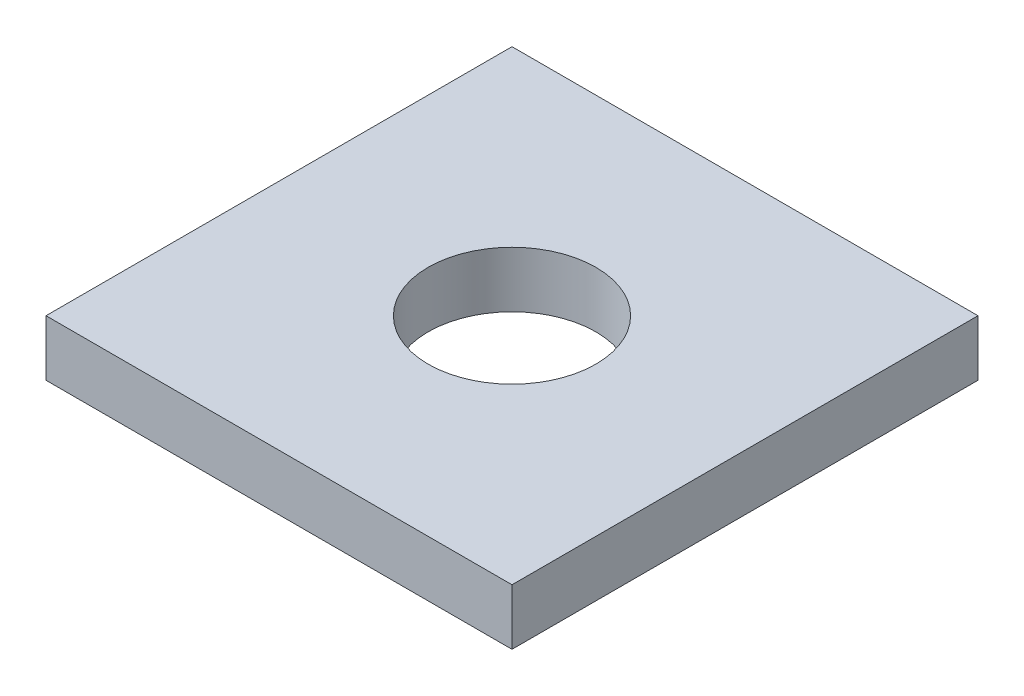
ISO-10303-21;
HEADER;
FILE_DESCRIPTION(('STEP AP214'),'2;1');
FILE_NAME('part.step','',(''),(''),'','','');
FILE_SCHEMA(('AUTOMOTIVE_DESIGN { 1 0 10303 214 1 1 1 1 }'));
ENDSEC;
DATA;
#1=APPLICATION_CONTEXT('core data for automotive mechanical design processes');
#2=APPLICATION_PROTOCOL_DEFINITION('international standard','automotive_design',2000,#1);
#3=PRODUCT_CONTEXT('',#1,'mechanical');
#4=PRODUCT('Part','Part','',(#3));
#5=PRODUCT_RELATED_PRODUCT_CATEGORY('part','',(#4));
#6=PRODUCT_DEFINITION_FORMATION('','',#4);
#7=PRODUCT_DEFINITION_CONTEXT('part definition',#1,'design');
#8=PRODUCT_DEFINITION('design','',#6,#7);
#9=PRODUCT_DEFINITION_SHAPE('','',#8);
#10=(LENGTH_UNIT() NAMED_UNIT(*) SI_UNIT(.MILLI.,.METRE.));
#11=(NAMED_UNIT(*) PLANE_ANGLE_UNIT() SI_UNIT($,.RADIAN.));
#12=(NAMED_UNIT(*) SI_UNIT($,.STERADIAN.) SOLID_ANGLE_UNIT());
#13=UNCERTAINTY_MEASURE_WITH_UNIT(LENGTH_MEASURE(1.E-05),#10,'distance_accuracy_value','');
#14=(GEOMETRIC_REPRESENTATION_CONTEXT(3) GLOBAL_UNCERTAINTY_ASSIGNED_CONTEXT((#13)) GLOBAL_UNIT_ASSIGNED_CONTEXT((#10,
#11,#12)) REPRESENTATION_CONTEXT('',''));
#15=CARTESIAN_POINT('',(0.,0.,0.));
#16=DIRECTION('',(0.,0.,1.));
#17=DIRECTION('',(1.,0.,0.));
#18=AXIS2_PLACEMENT_3D('',#15,#16,#17);
#19=CARTESIAN_POINT('',(0.,3.,-25.));
#20=DIRECTION('',(0.,-1.,0.));
#21=DIRECTION('',(0.,0.,-1.));
#22=AXIS2_PLACEMENT_3D('',#19,#20,#21);
#23=PLANE('',#22);
#24=DIRECTION('',(0.,0.,1.));
#25=VECTOR('',#24,1.);
#26=CARTESIAN_POINT('',(0.,3.,0.));
#27=LINE('',#26,#25);
#28=CARTESIAN_POINT('',(0.,3.,-25.));
#29=VERTEX_POINT('',#28);
#30=CARTESIAN_POINT('',(0.,3.,0.));
#31=VERTEX_POINT('',#30);
#32=EDGE_CURVE('E83',#29,#31,#27,.T.);
#33=ORIENTED_EDGE('',*,*,#32,.T.);
#34=DIRECTION('',(1.,0.,0.));
#35=VECTOR('',#34,1.);
#36=CARTESIAN_POINT('',(0.,3.,0.));
#37=LINE('',#36,#35);
#38=CARTESIAN_POINT('',(25.,3.,0.));
#39=VERTEX_POINT('',#38);
#40=EDGE_CURVE('E78',#31,#39,#37,.T.);
#41=ORIENTED_EDGE('',*,*,#40,.T.);
#42=DIRECTION('',(0.,0.,-1.));
#43=VECTOR('',#42,1.);
#44=CARTESIAN_POINT('',(25.,3.,0.));
#45=LINE('',#44,#43);
#46=CARTESIAN_POINT('',(25.,3.,-25.));
#47=VERTEX_POINT('',#46);
#48=EDGE_CURVE('E81',#39,#47,#45,.T.);
#49=ORIENTED_EDGE('',*,*,#48,.T.);
#50=DIRECTION('',(-1.,0.,0.));
#51=VECTOR('',#50,1.);
#52=CARTESIAN_POINT('',(0.,3.,-25.));
#53=LINE('',#52,#51);
#54=EDGE_CURVE('E48',#47,#29,#53,.T.);
#55=ORIENTED_EDGE('',*,*,#54,.T.);
#56=EDGE_LOOP('',(#33,#41,#49,#55));
#57=FACE_BOUND('',#56,.T.);
#58=CARTESIAN_POINT('',(12.5,3.,-12.5));
#59=DIRECTION('',(0.,1.,0.));
#60=DIRECTION('',(0.,0.,1.));
#61=AXIS2_PLACEMENT_3D('',#58,#59,#60);
#62=CIRCLE('',#61,4.5);
#63=CARTESIAN_POINT('',(12.5,3.,-8.));
#64=VERTEX_POINT('',#63);
#65=EDGE_CURVE('E98',#64,#64,#62,.T.);
#66=ORIENTED_EDGE('',*,*,#65,.F.);
#67=EDGE_LOOP('',(#66));
#68=FACE_BOUND('',#67,.T.);
#69=ADVANCED_FACE('F31',(#57,#68),#23,.F.);
#70=CARTESIAN_POINT('',(0.,0.,-25.));
#71=DIRECTION('',(0.,-1.,0.));
#72=DIRECTION('',(0.,0.,-1.));
#73=AXIS2_PLACEMENT_3D('',#70,#71,#72);
#74=PLANE('',#73);
#75=DIRECTION('',(0.,0.,1.));
#76=VECTOR('',#75,1.);
#77=CARTESIAN_POINT('',(0.,0.,0.));
#78=LINE('',#77,#76);
#79=CARTESIAN_POINT('',(0.,0.,-25.));
#80=VERTEX_POINT('',#79);
#81=CARTESIAN_POINT('',(0.,0.,0.));
#82=VERTEX_POINT('',#81);
#83=EDGE_CURVE('E95',#80,#82,#78,.T.);
#84=ORIENTED_EDGE('',*,*,#83,.F.);
#85=DIRECTION('',(-1.,0.,0.));
#86=VECTOR('',#85,1.);
#87=CARTESIAN_POINT('',(0.,0.,-25.));
#88=LINE('',#87,#86);
#89=CARTESIAN_POINT('',(25.,0.,-25.));
#90=VERTEX_POINT('',#89);
#91=EDGE_CURVE('E71',#90,#80,#88,.T.);
#92=ORIENTED_EDGE('',*,*,#91,.F.);
#93=DIRECTION('',(0.,0.,-1.));
#94=VECTOR('',#93,1.);
#95=CARTESIAN_POINT('',(25.,0.,0.));
#96=LINE('',#95,#94);
#97=CARTESIAN_POINT('',(25.,0.,0.));
#98=VERTEX_POINT('',#97);
#99=EDGE_CURVE('E65',#98,#90,#96,.T.);
#100=ORIENTED_EDGE('',*,*,#99,.F.);
#101=DIRECTION('',(1.,0.,0.));
#102=VECTOR('',#101,1.);
#103=CARTESIAN_POINT('',(0.,0.,0.));
#104=LINE('',#103,#102);
#105=EDGE_CURVE('E87',#82,#98,#104,.T.);
#106=ORIENTED_EDGE('',*,*,#105,.F.);
#107=EDGE_LOOP('',(#84,#92,#100,#106));
#108=FACE_BOUND('',#107,.T.);
#109=CARTESIAN_POINT('',(12.5,0.,-12.5));
#110=DIRECTION('',(0.,1.,0.));
#111=DIRECTION('',(0.,0.,1.));
#112=AXIS2_PLACEMENT_3D('',#109,#110,#111);
#113=CIRCLE('',#112,4.5);
#114=CARTESIAN_POINT('',(12.5,0.,-8.));
#115=VERTEX_POINT('',#114);
#116=EDGE_CURVE('E110',#115,#115,#113,.T.);
#117=ORIENTED_EDGE('',*,*,#116,.T.);
#118=EDGE_LOOP('',(#117));
#119=FACE_BOUND('',#118,.T.);
#120=ADVANCED_FACE('F106',(#108,#119),#74,.T.);
#121=CARTESIAN_POINT('',(0.,3.,0.));
#122=DIRECTION('',(1.,0.,0.));
#123=DIRECTION('',(0.,0.,-1.));
#124=AXIS2_PLACEMENT_3D('',#121,#122,#123);
#125=PLANE('',#124);
#126=ORIENTED_EDGE('',*,*,#83,.T.);
#127=DIRECTION('',(0.,-1.,0.));
#128=VECTOR('',#127,1.);
#129=CARTESIAN_POINT('',(0.,3.,0.));
#130=LINE('',#129,#128);
#131=EDGE_CURVE('E11',#31,#82,#130,.T.);
#132=ORIENTED_EDGE('',*,*,#131,.F.);
#133=ORIENTED_EDGE('',*,*,#32,.F.);
#134=DIRECTION('',(0.,-1.,0.));
#135=VECTOR('',#134,1.);
#136=CARTESIAN_POINT('',(0.,3.,-25.));
#137=LINE('',#136,#135);
#138=EDGE_CURVE('E91',#29,#80,#137,.T.);
#139=ORIENTED_EDGE('',*,*,#138,.T.);
#140=EDGE_LOOP('',(#126,#132,#133,#139));
#141=FACE_BOUND('',#140,.T.);
#142=ADVANCED_FACE('F33',(#141),#125,.F.);
#143=CARTESIAN_POINT('',(0.,3.,0.));
#144=DIRECTION('',(0.,0.,-1.));
#145=DIRECTION('',(-1.,0.,0.));
#146=AXIS2_PLACEMENT_3D('',#143,#144,#145);
#147=PLANE('',#146);
#148=ORIENTED_EDGE('',*,*,#105,.T.);
#149=DIRECTION('',(0.,-1.,0.));
#150=VECTOR('',#149,1.);
#151=CARTESIAN_POINT('',(25.,3.,0.));
#152=LINE('',#151,#150);
#153=EDGE_CURVE('E40',#39,#98,#152,.T.);
#154=ORIENTED_EDGE('',*,*,#153,.F.);
#155=ORIENTED_EDGE('',*,*,#40,.F.);
#156=ORIENTED_EDGE('',*,*,#131,.T.);
#157=EDGE_LOOP('',(#148,#154,#155,#156));
#158=FACE_BOUND('',#157,.T.);
#159=ADVANCED_FACE('F86',(#158),#147,.F.);
#160=CARTESIAN_POINT('',(25.,3.,0.));
#161=DIRECTION('',(-1.,0.,0.));
#162=DIRECTION('',(0.,0.,1.));
#163=AXIS2_PLACEMENT_3D('',#160,#161,#162);
#164=PLANE('',#163);
#165=ORIENTED_EDGE('',*,*,#99,.T.);
#166=DIRECTION('',(0.,-1.,0.));
#167=VECTOR('',#166,1.);
#168=CARTESIAN_POINT('',(25.,3.,-25.));
#169=LINE('',#168,#167);
#170=EDGE_CURVE('E88',#47,#90,#169,.T.);
#171=ORIENTED_EDGE('',*,*,#170,.F.);
#172=ORIENTED_EDGE('',*,*,#48,.F.);
#173=ORIENTED_EDGE('',*,*,#153,.T.);
#174=EDGE_LOOP('',(#165,#171,#172,#173));
#175=FACE_BOUND('',#174,.T.);
#176=ADVANCED_FACE('F89',(#175),#164,.F.);
#177=CARTESIAN_POINT('',(0.,3.,-25.));
#178=DIRECTION('',(0.,0.,1.));
#179=DIRECTION('',(1.,0.,0.));
#180=AXIS2_PLACEMENT_3D('',#177,#178,#179);
#181=PLANE('',#180);
#182=ORIENTED_EDGE('',*,*,#91,.T.);
#183=ORIENTED_EDGE('',*,*,#138,.F.);
#184=ORIENTED_EDGE('',*,*,#54,.F.);
#185=ORIENTED_EDGE('',*,*,#170,.T.);
#186=EDGE_LOOP('',(#182,#183,#184,#185));
#187=FACE_BOUND('',#186,.T.);
#188=ADVANCED_FACE('F103',(#187),#181,.F.);
#189=CARTESIAN_POINT('',(12.5,3.,-12.5));
#190=DIRECTION('',(0.,-1.,0.));
#191=DIRECTION('',(0.,0.,-1.));
#192=AXIS2_PLACEMENT_3D('',#189,#190,#191);
#193=CYLINDRICAL_SURFACE('',#192,4.5);
#194=ORIENTED_EDGE('',*,*,#65,.T.);
#195=EDGE_LOOP('',(#194));
#196=FACE_BOUND('',#195,.T.);
#197=ORIENTED_EDGE('',*,*,#116,.F.);
#198=EDGE_LOOP('',(#197));
#199=FACE_BOUND('',#198,.T.);
#200=ADVANCED_FACE('F116',(#196,#199),#193,.F.);
#201=CLOSED_SHELL('',(#69,#120,#142,#159,#176,#188,#200));
#202=MANIFOLD_SOLID_BREP('B2',#201);
#203=ADVANCED_BREP_SHAPE_REPRESENTATION('',(#18,#202),#14);
#204=SHAPE_DEFINITION_REPRESENTATION(#9,#203);
ENDSEC;
END-ISO-10303-21;
